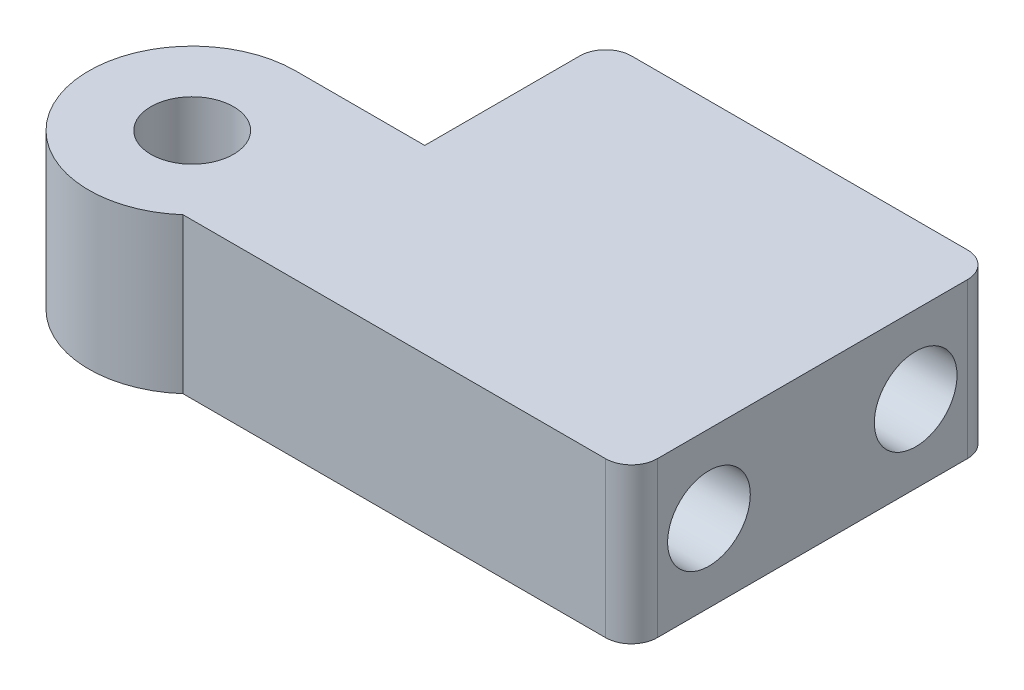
from build123d import *

# Parameters (mm, degrees)
SKETCH_1_R          = 1.6
EXTRUDE_1_DEPTH     = 6
SKETCH_2_R          = 1.6
CUT_EXTRUDE_1_DEPTH = 10
FILLET_1_R          = 1


with BuildPart() as part:
    # Sketch 1 → Extrude 1 (new body)
    with BuildSketch(Plane(origin=(0, 0, 0), x_dir=(1, 0, 0), z_dir=(0, 1, 0))):
        with BuildLine():
            ThreePointArc((0, 4), (-3.741657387, -1.414213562), (2.645751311, -3))
            Line((2.645751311, -3), (20, -3))
            Line((20, -3), (20, 11))
            Line((20, 11), (5, 11))
            Line((5, 11), (5, 4))
            Line((5, 4), (0, 4))
        make_face()
        with Locations(Location((0, 0, 0), (0, 0, 270))):
            Circle(SKETCH_1_R, mode=Mode.SUBTRACT)
    extrude(amount=EXTRUDE_1_DEPTH)

    # Sketch 2 → Cut-Extrude 1 (cut)
    with BuildSketch(Plane(origin=(20, 0, 0), x_dir=(0, 0, -1), z_dir=(1, 0, 0))):
        with Locations((8, 3)):
            Circle(SKETCH_2_R)
        with Locations((0, 3)):
            Circle(SKETCH_2_R)
    extrude(amount=-CUT_EXTRUDE_1_DEPTH, mode=Mode.SUBTRACT)

    # Fillet 1
    fillet_1_edges = [part.edges().sort_by_distance(p)[0] for p in [
        (20, 3, 3),
        (5, 3, -11),
        (20, 3, -11),
    ]]
    fillet(fillet_1_edges, radius=FILLET_1_R)


solid = part.part
